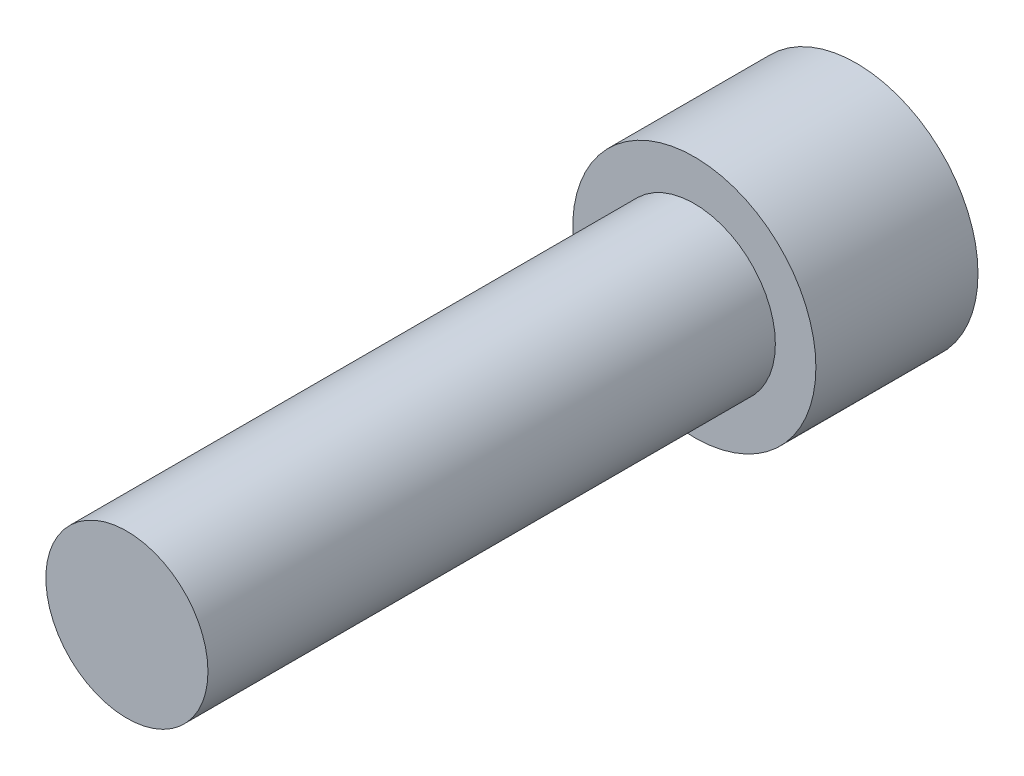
from build123d import *

# Parameters (mm, degrees)
HEX_2_DEPTH = 3.556


with BuildPart() as part:
    # Sketch6 → Revolve1 (revolve)
    with BuildSketch(Plane(origin=(0, 0, 0), x_dir=(0, 0, -1), z_dir=(1, 0, 0)), mode=Mode.PRIVATE) as revolve1_sk:
        Polygon((-22.225, 0), (-22.225, -3.175), (0, -3.175), (0, -4.7625), (6.35, -4.7625), (6.35, 0), align=None)
    revolve(revolve1_sk.sketch.rotate(Axis((0, 0, 22.225), (0, 0, -1)), 270), axis=Axis((0, 0, 22.225), (0, 0, -1)))

    # Sketch7 → HEX 2 (cut)
    with BuildSketch(Plane(origin=(0, 0, -6.35), x_dir=(-1, 0, 0), z_dir=(0, 0, -1))):
        Polygon((-2.3876, 1.378481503), (-2.3876, -1.378481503), (0, -2.756963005), (2.3876, -1.378481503), (2.3876, 1.378481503), (0, 2.756963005), align=None)
    extrude(amount=-HEX_2_DEPTH, mode=Mode.SUBTRACT)


solid = part.part
